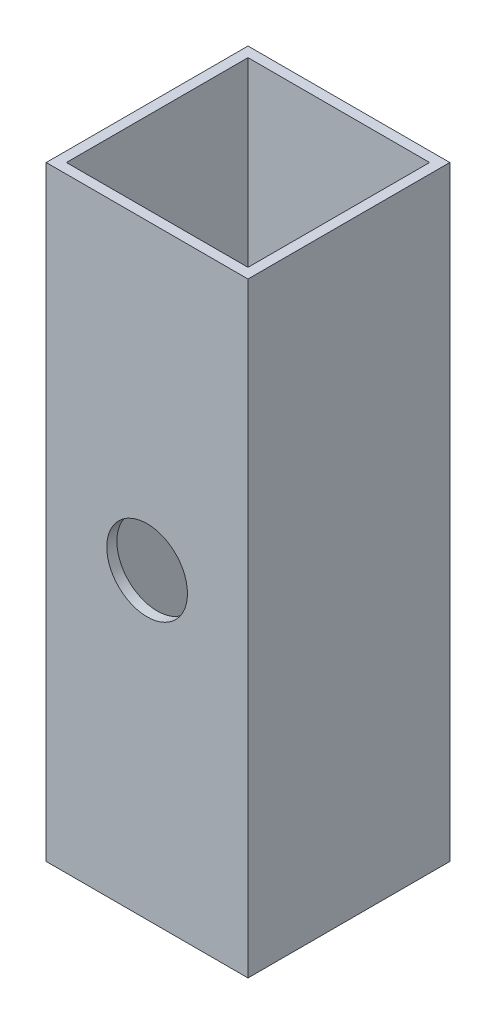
ISO-10303-21;
HEADER;
FILE_DESCRIPTION(('STEP AP214'),'2;1');
FILE_NAME('part.step','',(''),(''),'','','');
FILE_SCHEMA(('AUTOMOTIVE_DESIGN { 1 0 10303 214 1 1 1 1 }'));
ENDSEC;
DATA;
#1=APPLICATION_CONTEXT('core data for automotive mechanical design processes');
#2=APPLICATION_PROTOCOL_DEFINITION('international standard','automotive_design',2000,#1);
#3=PRODUCT_CONTEXT('',#1,'mechanical');
#4=PRODUCT('Part','Part','',(#3));
#5=PRODUCT_RELATED_PRODUCT_CATEGORY('part','',(#4));
#6=PRODUCT_DEFINITION_FORMATION('','',#4);
#7=PRODUCT_DEFINITION_CONTEXT('part definition',#1,'design');
#8=PRODUCT_DEFINITION('design','',#6,#7);
#9=PRODUCT_DEFINITION_SHAPE('','',#8);
#10=(LENGTH_UNIT() NAMED_UNIT(*) SI_UNIT(.MILLI.,.METRE.));
#11=(NAMED_UNIT(*) PLANE_ANGLE_UNIT() SI_UNIT($,.RADIAN.));
#12=(NAMED_UNIT(*) SI_UNIT($,.STERADIAN.) SOLID_ANGLE_UNIT());
#13=UNCERTAINTY_MEASURE_WITH_UNIT(LENGTH_MEASURE(1.E-05),#10,'distance_accuracy_value','');
#14=(GEOMETRIC_REPRESENTATION_CONTEXT(3) GLOBAL_UNCERTAINTY_ASSIGNED_CONTEXT((#13)) GLOBAL_UNIT_ASSIGNED_CONTEXT((#10,
#11,#12)) REPRESENTATION_CONTEXT('',''));
#15=CARTESIAN_POINT('',(0.,0.,0.));
#16=DIRECTION('',(0.,0.,1.));
#17=DIRECTION('',(1.,0.,0.));
#18=AXIS2_PLACEMENT_3D('',#15,#16,#17);
#19=CARTESIAN_POINT('',(25.,150.,-25.));
#20=DIRECTION('',(-1.,0.,0.));
#21=DIRECTION('',(0.,0.,1.));
#22=AXIS2_PLACEMENT_3D('',#19,#20,#21);
#23=PLANE('',#22);
#24=DIRECTION('',(0.,0.,-1.));
#25=VECTOR('',#24,1.);
#26=CARTESIAN_POINT('',(25.,0.,-25.));
#27=LINE('',#26,#25);
#28=CARTESIAN_POINT('',(25.,0.,25.));
#29=VERTEX_POINT('',#28);
#30=CARTESIAN_POINT('',(25.,0.,-25.));
#31=VERTEX_POINT('',#30);
#32=EDGE_CURVE('E163',#29,#31,#27,.T.);
#33=ORIENTED_EDGE('',*,*,#32,.T.);
#34=DIRECTION('',(0.,-1.,0.));
#35=VECTOR('',#34,1.);
#36=CARTESIAN_POINT('',(25.,150.,-25.));
#37=LINE('',#36,#35);
#38=CARTESIAN_POINT('',(25.,150.,-25.));
#39=VERTEX_POINT('',#38);
#40=EDGE_CURVE('E11',#39,#31,#37,.T.);
#41=ORIENTED_EDGE('',*,*,#40,.F.);
#42=DIRECTION('',(0.,0.,-1.));
#43=VECTOR('',#42,1.);
#44=CARTESIAN_POINT('',(25.,150.,-25.));
#45=LINE('',#44,#43);
#46=CARTESIAN_POINT('',(25.,150.,25.));
#47=VERTEX_POINT('',#46);
#48=EDGE_CURVE('E148',#47,#39,#45,.T.);
#49=ORIENTED_EDGE('',*,*,#48,.F.);
#50=DIRECTION('',(0.,-1.,0.));
#51=VECTOR('',#50,1.);
#52=CARTESIAN_POINT('',(25.,150.,25.));
#53=LINE('',#52,#51);
#54=EDGE_CURVE('E162',#47,#29,#53,.T.);
#55=ORIENTED_EDGE('',*,*,#54,.T.);
#56=EDGE_LOOP('',(#33,#41,#49,#55));
#57=FACE_BOUND('',#56,.T.);
#58=ADVANCED_FACE('F39',(#57),#23,.F.);
#59=CARTESIAN_POINT('',(-25.,150.,-25.));
#60=DIRECTION('',(0.,0.,1.));
#61=DIRECTION('',(1.,0.,0.));
#62=AXIS2_PLACEMENT_3D('',#59,#60,#61);
#63=PLANE('',#62);
#64=CARTESIAN_POINT('',(0.,75.,-25.));
#65=DIRECTION('',(0.,0.,1.));
#66=DIRECTION('',(1.,0.,0.));
#67=AXIS2_PLACEMENT_3D('',#64,#65,#66);
#68=CIRCLE('',#67,10.);
#69=CARTESIAN_POINT('',(10.,75.,-25.));
#70=VERTEX_POINT('',#69);
#71=EDGE_CURVE('E247',#70,#70,#68,.T.);
#72=ORIENTED_EDGE('',*,*,#71,.T.);
#73=EDGE_LOOP('',(#72));
#74=FACE_BOUND('',#73,.T.);
#75=DIRECTION('',(-1.,0.,0.));
#76=VECTOR('',#75,1.);
#77=CARTESIAN_POINT('',(-25.,0.,-25.));
#78=LINE('',#77,#76);
#79=CARTESIAN_POINT('',(-25.,0.,-25.));
#80=VERTEX_POINT('',#79);
#81=EDGE_CURVE('E167',#31,#80,#78,.T.);
#82=ORIENTED_EDGE('',*,*,#81,.T.);
#83=DIRECTION('',(0.,-1.,0.));
#84=VECTOR('',#83,1.);
#85=CARTESIAN_POINT('',(-25.,150.,-25.));
#86=LINE('',#85,#84);
#87=CARTESIAN_POINT('',(-25.,150.,-25.));
#88=VERTEX_POINT('',#87);
#89=EDGE_CURVE('E48',#88,#80,#86,.T.);
#90=ORIENTED_EDGE('',*,*,#89,.F.);
#91=DIRECTION('',(-1.,0.,0.));
#92=VECTOR('',#91,1.);
#93=CARTESIAN_POINT('',(-25.,150.,-25.));
#94=LINE('',#93,#92);
#95=EDGE_CURVE('E152',#39,#88,#94,.T.);
#96=ORIENTED_EDGE('',*,*,#95,.F.);
#97=ORIENTED_EDGE('',*,*,#40,.T.);
#98=EDGE_LOOP('',(#82,#90,#96,#97));
#99=FACE_BOUND('',#98,.T.);
#100=ADVANCED_FACE('F202',(#74,#99),#63,.F.);
#101=CARTESIAN_POINT('',(-25.,150.,-25.));
#102=DIRECTION('',(1.,0.,0.));
#103=DIRECTION('',(0.,0.,-1.));
#104=AXIS2_PLACEMENT_3D('',#101,#102,#103);
#105=PLANE('',#104);
#106=DIRECTION('',(0.,0.,1.));
#107=VECTOR('',#106,1.);
#108=CARTESIAN_POINT('',(-25.,0.,-25.));
#109=LINE('',#108,#107);
#110=CARTESIAN_POINT('',(-25.,0.,25.));
#111=VERTEX_POINT('',#110);
#112=EDGE_CURVE('E170',#80,#111,#109,.T.);
#113=ORIENTED_EDGE('',*,*,#112,.T.);
#114=DIRECTION('',(0.,-1.,0.));
#115=VECTOR('',#114,1.);
#116=CARTESIAN_POINT('',(-25.,150.,25.));
#117=LINE('',#116,#115);
#118=CARTESIAN_POINT('',(-25.,150.,25.));
#119=VERTEX_POINT('',#118);
#120=EDGE_CURVE('E178',#119,#111,#117,.T.);
#121=ORIENTED_EDGE('',*,*,#120,.F.);
#122=DIRECTION('',(0.,0.,1.));
#123=VECTOR('',#122,1.);
#124=CARTESIAN_POINT('',(-25.,150.,-25.));
#125=LINE('',#124,#123);
#126=EDGE_CURVE('E156',#88,#119,#125,.T.);
#127=ORIENTED_EDGE('',*,*,#126,.F.);
#128=ORIENTED_EDGE('',*,*,#89,.T.);
#129=EDGE_LOOP('',(#113,#121,#127,#128));
#130=FACE_BOUND('',#129,.T.);
#131=ADVANCED_FACE('F188',(#130),#105,.F.);
#132=CARTESIAN_POINT('',(-25.,150.,25.));
#133=DIRECTION('',(0.,0.,-1.));
#134=DIRECTION('',(-1.,0.,0.));
#135=AXIS2_PLACEMENT_3D('',#132,#133,#134);
#136=PLANE('',#135);
#137=CARTESIAN_POINT('',(0.,75.,25.));
#138=DIRECTION('',(0.,0.,1.));
#139=DIRECTION('',(1.,0.,0.));
#140=AXIS2_PLACEMENT_3D('',#137,#138,#139);
#141=CIRCLE('',#140,10.);
#142=CARTESIAN_POINT('',(10.,75.,25.));
#143=VERTEX_POINT('',#142);
#144=EDGE_CURVE('E245',#143,#143,#141,.T.);
#145=ORIENTED_EDGE('',*,*,#144,.F.);
#146=EDGE_LOOP('',(#145));
#147=FACE_BOUND('',#146,.T.);
#148=DIRECTION('',(1.,0.,0.));
#149=VECTOR('',#148,1.);
#150=CARTESIAN_POINT('',(-25.,0.,25.));
#151=LINE('',#150,#149);
#152=EDGE_CURVE('E153',#111,#29,#151,.T.);
#153=ORIENTED_EDGE('',*,*,#152,.T.);
#154=ORIENTED_EDGE('',*,*,#54,.F.);
#155=DIRECTION('',(1.,0.,0.));
#156=VECTOR('',#155,1.);
#157=CARTESIAN_POINT('',(-25.,150.,25.));
#158=LINE('',#157,#156);
#159=EDGE_CURVE('E159',#119,#47,#158,.T.);
#160=ORIENTED_EDGE('',*,*,#159,.F.);
#161=ORIENTED_EDGE('',*,*,#120,.T.);
#162=EDGE_LOOP('',(#153,#154,#160,#161));
#163=FACE_BOUND('',#162,.T.);
#164=ADVANCED_FACE('F195',(#147,#163),#136,.F.);
#165=CARTESIAN_POINT('',(0.,150.,0.));
#166=DIRECTION('',(0.,1.,0.));
#167=DIRECTION('',(0.,0.,1.));
#168=AXIS2_PLACEMENT_3D('',#165,#166,#167);
#169=PLANE('',#168);
#170=DIRECTION('',(0.,0.,-1.));
#171=VECTOR('',#170,1.);
#172=CARTESIAN_POINT('',(22.5,150.,-25.));
#173=LINE('',#172,#171);
#174=CARTESIAN_POINT('',(22.5,150.,22.5));
#175=VERTEX_POINT('',#174);
#176=CARTESIAN_POINT('',(22.5,150.,-22.5));
#177=VERTEX_POINT('',#176);
#178=EDGE_CURVE('E130',#175,#177,#173,.T.);
#179=ORIENTED_EDGE('',*,*,#178,.F.);
#180=DIRECTION('',(1.,0.,0.));
#181=VECTOR('',#180,1.);
#182=CARTESIAN_POINT('',(-25.,150.,22.5));
#183=LINE('',#182,#181);
#184=CARTESIAN_POINT('',(-22.5,150.,22.5));
#185=VERTEX_POINT('',#184);
#186=EDGE_CURVE('E110',#185,#175,#183,.T.);
#187=ORIENTED_EDGE('',*,*,#186,.F.);
#188=DIRECTION('',(0.,0.,1.));
#189=VECTOR('',#188,1.);
#190=CARTESIAN_POINT('',(-22.5,150.,-25.));
#191=LINE('',#190,#189);
#192=CARTESIAN_POINT('',(-22.5,150.,-22.5));
#193=VERTEX_POINT('',#192);
#194=EDGE_CURVE('E143',#193,#185,#191,.T.);
#195=ORIENTED_EDGE('',*,*,#194,.F.);
#196=DIRECTION('',(-1.,0.,0.));
#197=VECTOR('',#196,1.);
#198=CARTESIAN_POINT('',(-25.,150.,-22.5));
#199=LINE('',#198,#197);
#200=EDGE_CURVE('E134',#177,#193,#199,.T.);
#201=ORIENTED_EDGE('',*,*,#200,.F.);
#202=EDGE_LOOP('',(#179,#187,#195,#201));
#203=FACE_BOUND('',#202,.T.);
#204=ORIENTED_EDGE('',*,*,#48,.T.);
#205=ORIENTED_EDGE('',*,*,#95,.T.);
#206=ORIENTED_EDGE('',*,*,#126,.T.);
#207=ORIENTED_EDGE('',*,*,#159,.T.);
#208=EDGE_LOOP('',(#204,#205,#206,#207));
#209=FACE_BOUND('',#208,.T.);
#210=ADVANCED_FACE('F201',(#203,#209),#169,.T.);
#211=CARTESIAN_POINT('',(0.,0.,0.));
#212=DIRECTION('',(0.,1.,0.));
#213=DIRECTION('',(0.,0.,1.));
#214=AXIS2_PLACEMENT_3D('',#211,#212,#213);
#215=PLANE('',#214);
#216=DIRECTION('',(1.,0.,0.));
#217=VECTOR('',#216,1.);
#218=CARTESIAN_POINT('',(-25.,0.,22.5));
#219=LINE('',#218,#217);
#220=CARTESIAN_POINT('',(-22.5,0.,22.5));
#221=VERTEX_POINT('',#220);
#222=CARTESIAN_POINT('',(22.5,0.,22.5));
#223=VERTEX_POINT('',#222);
#224=EDGE_CURVE('E108',#221,#223,#219,.T.);
#225=ORIENTED_EDGE('',*,*,#224,.T.);
#226=DIRECTION('',(0.,0.,-1.));
#227=VECTOR('',#226,1.);
#228=CARTESIAN_POINT('',(22.5,0.,-25.));
#229=LINE('',#228,#227);
#230=CARTESIAN_POINT('',(22.5,0.,-22.5));
#231=VERTEX_POINT('',#230);
#232=EDGE_CURVE('E117',#223,#231,#229,.T.);
#233=ORIENTED_EDGE('',*,*,#232,.T.);
#234=DIRECTION('',(-1.,0.,0.));
#235=VECTOR('',#234,1.);
#236=CARTESIAN_POINT('',(-25.,0.,-22.5));
#237=LINE('',#236,#235);
#238=CARTESIAN_POINT('',(-22.5,0.,-22.5));
#239=VERTEX_POINT('',#238);
#240=EDGE_CURVE('E124',#231,#239,#237,.T.);
#241=ORIENTED_EDGE('',*,*,#240,.T.);
#242=DIRECTION('',(0.,0.,1.));
#243=VECTOR('',#242,1.);
#244=CARTESIAN_POINT('',(-22.5,0.,-25.));
#245=LINE('',#244,#243);
#246=EDGE_CURVE('E62',#239,#221,#245,.T.);
#247=ORIENTED_EDGE('',*,*,#246,.T.);
#248=EDGE_LOOP('',(#225,#233,#241,#247));
#249=FACE_BOUND('',#248,.T.);
#250=ORIENTED_EDGE('',*,*,#32,.F.);
#251=ORIENTED_EDGE('',*,*,#152,.F.);
#252=ORIENTED_EDGE('',*,*,#112,.F.);
#253=ORIENTED_EDGE('',*,*,#81,.F.);
#254=EDGE_LOOP('',(#250,#251,#252,#253));
#255=FACE_BOUND('',#254,.T.);
#256=ADVANCED_FACE('F127',(#249,#255),#215,.F.);
#257=CARTESIAN_POINT('',(22.5,150.,-25.));
#258=DIRECTION('',(-1.,0.,0.));
#259=DIRECTION('',(0.,0.,1.));
#260=AXIS2_PLACEMENT_3D('',#257,#258,#259);
#261=PLANE('',#260);
#262=ORIENTED_EDGE('',*,*,#232,.F.);
#263=DIRECTION('',(0.,-1.,0.));
#264=VECTOR('',#263,1.);
#265=CARTESIAN_POINT('',(22.5,150.,22.5));
#266=LINE('',#265,#264);
#267=EDGE_CURVE('E104',#175,#223,#266,.T.);
#268=ORIENTED_EDGE('',*,*,#267,.F.);
#269=ORIENTED_EDGE('',*,*,#178,.T.);
#270=DIRECTION('',(0.,-1.,0.));
#271=VECTOR('',#270,1.);
#272=CARTESIAN_POINT('',(22.5,150.,-22.5));
#273=LINE('',#272,#271);
#274=EDGE_CURVE('E120',#177,#231,#273,.T.);
#275=ORIENTED_EDGE('',*,*,#274,.T.);
#276=EDGE_LOOP('',(#262,#268,#269,#275));
#277=FACE_BOUND('',#276,.T.);
#278=ADVANCED_FACE('F118',(#277),#261,.T.);
#279=CARTESIAN_POINT('',(-25.,150.,-22.5));
#280=DIRECTION('',(0.,0.,1.));
#281=DIRECTION('',(1.,0.,0.));
#282=AXIS2_PLACEMENT_3D('',#279,#280,#281);
#283=PLANE('',#282);
#284=CARTESIAN_POINT('',(0.,75.,-22.5));
#285=DIRECTION('',(0.,0.,1.));
#286=DIRECTION('',(1.,0.,0.));
#287=AXIS2_PLACEMENT_3D('',#284,#285,#286);
#288=CIRCLE('',#287,10.);
#289=CARTESIAN_POINT('',(10.,75.,-22.5));
#290=VERTEX_POINT('',#289);
#291=EDGE_CURVE('E125',#290,#290,#288,.T.);
#292=ORIENTED_EDGE('',*,*,#291,.F.);
#293=EDGE_LOOP('',(#292));
#294=FACE_BOUND('',#293,.T.);
#295=ORIENTED_EDGE('',*,*,#240,.F.);
#296=ORIENTED_EDGE('',*,*,#274,.F.);
#297=ORIENTED_EDGE('',*,*,#200,.T.);
#298=DIRECTION('',(0.,-1.,0.));
#299=VECTOR('',#298,1.);
#300=CARTESIAN_POINT('',(-22.5,150.,-22.5));
#301=LINE('',#300,#299);
#302=EDGE_CURVE('E256',#193,#239,#301,.T.);
#303=ORIENTED_EDGE('',*,*,#302,.T.);
#304=EDGE_LOOP('',(#295,#296,#297,#303));
#305=FACE_BOUND('',#304,.T.);
#306=ADVANCED_FACE('F227',(#294,#305),#283,.T.);
#307=CARTESIAN_POINT('',(-22.5,150.,-25.));
#308=DIRECTION('',(1.,0.,0.));
#309=DIRECTION('',(0.,0.,-1.));
#310=AXIS2_PLACEMENT_3D('',#307,#308,#309);
#311=PLANE('',#310);
#312=ORIENTED_EDGE('',*,*,#246,.F.);
#313=ORIENTED_EDGE('',*,*,#302,.F.);
#314=ORIENTED_EDGE('',*,*,#194,.T.);
#315=DIRECTION('',(0.,-1.,0.));
#316=VECTOR('',#315,1.);
#317=CARTESIAN_POINT('',(-22.5,150.,22.5));
#318=LINE('',#317,#316);
#319=EDGE_CURVE('E55',#185,#221,#318,.T.);
#320=ORIENTED_EDGE('',*,*,#319,.T.);
#321=EDGE_LOOP('',(#312,#313,#314,#320));
#322=FACE_BOUND('',#321,.T.);
#323=ADVANCED_FACE('F223',(#322),#311,.T.);
#324=CARTESIAN_POINT('',(-25.,150.,22.5));
#325=DIRECTION('',(0.,0.,-1.));
#326=DIRECTION('',(-1.,0.,0.));
#327=AXIS2_PLACEMENT_3D('',#324,#325,#326);
#328=PLANE('',#327);
#329=CARTESIAN_POINT('',(0.,75.,22.5));
#330=DIRECTION('',(0.,0.,-1.));
#331=DIRECTION('',(-1.,0.,0.));
#332=AXIS2_PLACEMENT_3D('',#329,#330,#331);
#333=CIRCLE('',#332,10.);
#334=CARTESIAN_POINT('',(-10.,75.,22.5));
#335=VERTEX_POINT('',#334);
#336=EDGE_CURVE('E42',#335,#335,#333,.T.);
#337=ORIENTED_EDGE('',*,*,#336,.F.);
#338=EDGE_LOOP('',(#337));
#339=FACE_BOUND('',#338,.T.);
#340=ORIENTED_EDGE('',*,*,#224,.F.);
#341=ORIENTED_EDGE('',*,*,#319,.F.);
#342=ORIENTED_EDGE('',*,*,#186,.T.);
#343=ORIENTED_EDGE('',*,*,#267,.T.);
#344=EDGE_LOOP('',(#340,#341,#342,#343));
#345=FACE_BOUND('',#344,.T.);
#346=ADVANCED_FACE('F106',(#339,#345),#328,.T.);
#347=CARTESIAN_POINT('',(0.,75.,-25.));
#348=DIRECTION('',(0.,0.,1.));
#349=DIRECTION('',(1.,0.,0.));
#350=AXIS2_PLACEMENT_3D('',#347,#348,#349);
#351=CYLINDRICAL_SURFACE('',#350,10.);
#352=ORIENTED_EDGE('',*,*,#336,.T.);
#353=EDGE_LOOP('',(#352));
#354=FACE_BOUND('',#353,.T.);
#355=ORIENTED_EDGE('',*,*,#144,.T.);
#356=EDGE_LOOP('',(#355));
#357=FACE_BOUND('',#356,.T.);
#358=ADVANCED_FACE('F222',(#354,#357),#351,.F.);
#359=ORIENTED_EDGE('',*,*,#291,.T.);
#360=EDGE_LOOP('',(#359));
#361=FACE_BOUND('',#360,.T.);
#362=ORIENTED_EDGE('',*,*,#71,.F.);
#363=EDGE_LOOP('',(#362));
#364=FACE_BOUND('',#363,.T.);
#365=ADVANCED_FACE('F234',(#361,#364),#351,.F.);
#366=CLOSED_SHELL('',(#58,#100,#131,#164,#210,#256,#278,#306,#323,#346,#358,#365));
#367=MANIFOLD_SOLID_BREP('B2',#366);
#368=ADVANCED_BREP_SHAPE_REPRESENTATION('',(#18,#367),#14);
#369=SHAPE_DEFINITION_REPRESENTATION(#9,#368);
ENDSEC;
END-ISO-10303-21;
